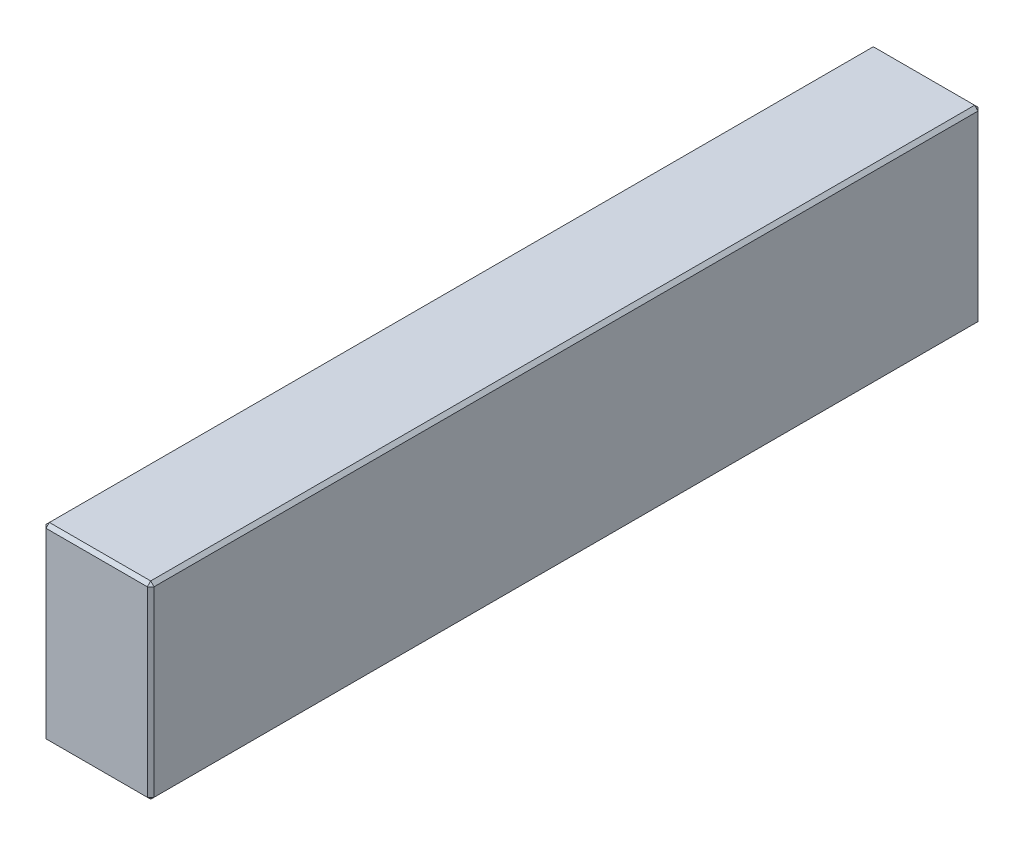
ISO-10303-21;
HEADER;
FILE_DESCRIPTION(('STEP AP214'),'2;1');
FILE_NAME('part.step','',(''),(''),'','','');
FILE_SCHEMA(('AUTOMOTIVE_DESIGN { 1 0 10303 214 1 1 1 1 }'));
ENDSEC;
DATA;
#1=APPLICATION_CONTEXT('core data for automotive mechanical design processes');
#2=APPLICATION_PROTOCOL_DEFINITION('international standard','automotive_design',2000,#1);
#3=PRODUCT_CONTEXT('',#1,'mechanical');
#4=PRODUCT('Part','Part','',(#3));
#5=PRODUCT_RELATED_PRODUCT_CATEGORY('part','',(#4));
#6=PRODUCT_DEFINITION_FORMATION('','',#4);
#7=PRODUCT_DEFINITION_CONTEXT('part definition',#1,'design');
#8=PRODUCT_DEFINITION('design','',#6,#7);
#9=PRODUCT_DEFINITION_SHAPE('','',#8);
#10=(LENGTH_UNIT() NAMED_UNIT(*) SI_UNIT(.MILLI.,.METRE.));
#11=(NAMED_UNIT(*) PLANE_ANGLE_UNIT() SI_UNIT($,.RADIAN.));
#12=(NAMED_UNIT(*) SI_UNIT($,.STERADIAN.) SOLID_ANGLE_UNIT());
#13=UNCERTAINTY_MEASURE_WITH_UNIT(LENGTH_MEASURE(1.E-05),#10,'distance_accuracy_value','');
#14=(GEOMETRIC_REPRESENTATION_CONTEXT(3) GLOBAL_UNCERTAINTY_ASSIGNED_CONTEXT((#13)) GLOBAL_UNIT_ASSIGNED_CONTEXT((#10,
#11,#12)) REPRESENTATION_CONTEXT('',''));
#15=CARTESIAN_POINT('',(0.,0.,0.));
#16=DIRECTION('',(0.,0.,1.));
#17=DIRECTION('',(1.,0.,0.));
#18=AXIS2_PLACEMENT_3D('',#15,#16,#17);
#19=CARTESIAN_POINT('',(-16.,56.,123.));
#20=DIRECTION('',(1.,0.,0.));
#21=DIRECTION('',(0.,0.,-1.));
#22=AXIS2_PLACEMENT_3D('',#19,#20,#21);
#23=PLANE('',#22);
#24=DIRECTION('',(0.,-1.,0.));
#25=VECTOR('',#24,1.);
#26=CARTESIAN_POINT('',(-16.,56.,-122.));
#27=LINE('',#26,#25);
#28=CARTESIAN_POINT('',(-16.,55.,-122.));
#29=VERTEX_POINT('',#28);
#30=CARTESIAN_POINT('',(-16.,1.,-122.));
#31=VERTEX_POINT('',#30);
#32=EDGE_CURVE('E115',#29,#31,#27,.T.);
#33=ORIENTED_EDGE('',*,*,#32,.T.);
#34=DIRECTION('',(0.,0.,1.));
#35=VECTOR('',#34,1.);
#36=CARTESIAN_POINT('',(-16.,1.,123.));
#37=LINE('',#36,#35);
#38=CARTESIAN_POINT('',(-16.,1.,122.));
#39=VERTEX_POINT('',#38);
#40=EDGE_CURVE('E111',#31,#39,#37,.T.);
#41=ORIENTED_EDGE('',*,*,#40,.T.);
#42=DIRECTION('',(0.,1.,0.));
#43=VECTOR('',#42,1.);
#44=CARTESIAN_POINT('',(-16.,56.,122.));
#45=LINE('',#44,#43);
#46=CARTESIAN_POINT('',(-16.,55.,122.));
#47=VERTEX_POINT('',#46);
#48=EDGE_CURVE('E104',#39,#47,#45,.T.);
#49=ORIENTED_EDGE('',*,*,#48,.T.);
#50=DIRECTION('',(0.,0.,-1.));
#51=VECTOR('',#50,1.);
#52=CARTESIAN_POINT('',(-16.,55.,-123.));
#53=LINE('',#52,#51);
#54=EDGE_CURVE('E108',#47,#29,#53,.T.);
#55=ORIENTED_EDGE('',*,*,#54,.T.);
#56=EDGE_LOOP('',(#33,#41,#49,#55));
#57=FACE_BOUND('',#56,.T.);
#58=ADVANCED_FACE('F16',(#57),#23,.F.);
#59=CARTESIAN_POINT('',(16.,56.,123.));
#60=DIRECTION('',(0.,0.,-1.));
#61=DIRECTION('',(-1.,0.,0.));
#62=AXIS2_PLACEMENT_3D('',#59,#60,#61);
#63=PLANE('',#62);
#64=DIRECTION('',(-1.,0.,0.));
#65=VECTOR('',#64,1.);
#66=CARTESIAN_POINT('',(-16.,55.,123.));
#67=LINE('',#66,#65);
#68=CARTESIAN_POINT('',(15.,55.,123.));
#69=VERTEX_POINT('',#68);
#70=CARTESIAN_POINT('',(-15.,55.,123.));
#71=VERTEX_POINT('',#70);
#72=EDGE_CURVE('E165',#69,#71,#67,.T.);
#73=ORIENTED_EDGE('',*,*,#72,.T.);
#74=DIRECTION('',(0.,-1.,0.));
#75=VECTOR('',#74,1.);
#76=CARTESIAN_POINT('',(-15.,56.,123.));
#77=LINE('',#76,#75);
#78=CARTESIAN_POINT('',(-15.,1.,123.));
#79=VERTEX_POINT('',#78);
#80=EDGE_CURVE('E123',#71,#79,#77,.T.);
#81=ORIENTED_EDGE('',*,*,#80,.T.);
#82=DIRECTION('',(1.,0.,0.));
#83=VECTOR('',#82,1.);
#84=CARTESIAN_POINT('',(16.,1.,123.));
#85=LINE('',#84,#83);
#86=CARTESIAN_POINT('',(15.,1.,123.));
#87=VERTEX_POINT('',#86);
#88=EDGE_CURVE('E169',#79,#87,#85,.T.);
#89=ORIENTED_EDGE('',*,*,#88,.T.);
#90=DIRECTION('',(0.,1.,0.));
#91=VECTOR('',#90,1.);
#92=CARTESIAN_POINT('',(15.,56.,123.));
#93=LINE('',#92,#91);
#94=EDGE_CURVE('E167',#87,#69,#93,.T.);
#95=ORIENTED_EDGE('',*,*,#94,.T.);
#96=EDGE_LOOP('',(#73,#81,#89,#95));
#97=FACE_BOUND('',#96,.T.);
#98=ADVANCED_FACE('F276',(#97),#63,.F.);
#99=CARTESIAN_POINT('',(16.,56.,123.));
#100=DIRECTION('',(-1.,0.,0.));
#101=DIRECTION('',(0.,0.,1.));
#102=AXIS2_PLACEMENT_3D('',#99,#100,#101);
#103=PLANE('',#102);
#104=DIRECTION('',(0.,0.,-1.));
#105=VECTOR('',#104,1.);
#106=CARTESIAN_POINT('',(16.,1.,123.));
#107=LINE('',#106,#105);
#108=CARTESIAN_POINT('',(16.,1.,122.));
#109=VERTEX_POINT('',#108);
#110=CARTESIAN_POINT('',(16.,1.,-122.));
#111=VERTEX_POINT('',#110);
#112=EDGE_CURVE('E160',#109,#111,#107,.T.);
#113=ORIENTED_EDGE('',*,*,#112,.T.);
#114=DIRECTION('',(0.,1.,0.));
#115=VECTOR('',#114,1.);
#116=CARTESIAN_POINT('',(16.,56.,-122.));
#117=LINE('',#116,#115);
#118=CARTESIAN_POINT('',(16.,55.,-122.));
#119=VERTEX_POINT('',#118);
#120=EDGE_CURVE('E162',#111,#119,#117,.T.);
#121=ORIENTED_EDGE('',*,*,#120,.T.);
#122=DIRECTION('',(0.,0.,1.));
#123=VECTOR('',#122,1.);
#124=CARTESIAN_POINT('',(16.,55.,123.));
#125=LINE('',#124,#123);
#126=CARTESIAN_POINT('',(16.,55.,122.));
#127=VERTEX_POINT('',#126);
#128=EDGE_CURVE('E156',#119,#127,#125,.T.);
#129=ORIENTED_EDGE('',*,*,#128,.T.);
#130=DIRECTION('',(0.,-1.,0.));
#131=VECTOR('',#130,1.);
#132=CARTESIAN_POINT('',(16.,56.,122.));
#133=LINE('',#132,#131);
#134=EDGE_CURVE('E158',#127,#109,#133,.T.);
#135=ORIENTED_EDGE('',*,*,#134,.T.);
#136=EDGE_LOOP('',(#113,#121,#129,#135));
#137=FACE_BOUND('',#136,.T.);
#138=ADVANCED_FACE('F255',(#137),#103,.F.);
#139=CARTESIAN_POINT('',(16.,56.,-123.));
#140=DIRECTION('',(0.,0.,1.));
#141=DIRECTION('',(1.,0.,0.));
#142=AXIS2_PLACEMENT_3D('',#139,#140,#141);
#143=PLANE('',#142);
#144=DIRECTION('',(0.,-1.,0.));
#145=VECTOR('',#144,1.);
#146=CARTESIAN_POINT('',(15.,56.,-123.));
#147=LINE('',#146,#145);
#148=CARTESIAN_POINT('',(15.,55.,-123.));
#149=VERTEX_POINT('',#148);
#150=CARTESIAN_POINT('',(15.,1.,-123.));
#151=VERTEX_POINT('',#150);
#152=EDGE_CURVE('E149',#149,#151,#147,.T.);
#153=ORIENTED_EDGE('',*,*,#152,.T.);
#154=DIRECTION('',(-1.,0.,0.));
#155=VECTOR('',#154,1.);
#156=CARTESIAN_POINT('',(16.,1.,-123.));
#157=LINE('',#156,#155);
#158=CARTESIAN_POINT('',(-15.,1.,-123.));
#159=VERTEX_POINT('',#158);
#160=EDGE_CURVE('E154',#151,#159,#157,.T.);
#161=ORIENTED_EDGE('',*,*,#160,.T.);
#162=DIRECTION('',(0.,1.,0.));
#163=VECTOR('',#162,1.);
#164=CARTESIAN_POINT('',(-15.,56.,-123.));
#165=LINE('',#164,#163);
#166=CARTESIAN_POINT('',(-15.,55.,-123.));
#167=VERTEX_POINT('',#166);
#168=EDGE_CURVE('E151',#159,#167,#165,.T.);
#169=ORIENTED_EDGE('',*,*,#168,.T.);
#170=DIRECTION('',(1.,0.,0.));
#171=VECTOR('',#170,1.);
#172=CARTESIAN_POINT('',(16.,55.,-123.));
#173=LINE('',#172,#171);
#174=EDGE_CURVE('E147',#167,#149,#173,.T.);
#175=ORIENTED_EDGE('',*,*,#174,.T.);
#176=EDGE_LOOP('',(#153,#161,#169,#175));
#177=FACE_BOUND('',#176,.T.);
#178=ADVANCED_FACE('F285',(#177),#143,.F.);
#179=CARTESIAN_POINT('',(0.,56.,0.));
#180=DIRECTION('',(0.,1.,0.));
#181=DIRECTION('',(0.,0.,1.));
#182=AXIS2_PLACEMENT_3D('',#179,#180,#181);
#183=PLANE('',#182);
#184=DIRECTION('',(0.,0.,-1.));
#185=VECTOR('',#184,1.);
#186=CARTESIAN_POINT('',(15.,56.,-123.));
#187=LINE('',#186,#185);
#188=CARTESIAN_POINT('',(15.,56.,122.));
#189=VERTEX_POINT('',#188);
#190=CARTESIAN_POINT('',(15.,56.,-122.));
#191=VERTEX_POINT('',#190);
#192=EDGE_CURVE('E25',#189,#191,#187,.T.);
#193=ORIENTED_EDGE('',*,*,#192,.T.);
#194=DIRECTION('',(-1.,0.,0.));
#195=VECTOR('',#194,1.);
#196=CARTESIAN_POINT('',(-16.,56.,-122.));
#197=LINE('',#196,#195);
#198=CARTESIAN_POINT('',(-15.,56.,-122.));
#199=VERTEX_POINT('',#198);
#200=EDGE_CURVE('E10',#191,#199,#197,.T.);
#201=ORIENTED_EDGE('',*,*,#200,.T.);
#202=DIRECTION('',(0.,0.,1.));
#203=VECTOR('',#202,1.);
#204=CARTESIAN_POINT('',(-15.,56.,123.));
#205=LINE('',#204,#203);
#206=CARTESIAN_POINT('',(-15.,56.,122.));
#207=VERTEX_POINT('',#206);
#208=EDGE_CURVE('E181',#199,#207,#205,.T.);
#209=ORIENTED_EDGE('',*,*,#208,.T.);
#210=DIRECTION('',(1.,0.,0.));
#211=VECTOR('',#210,1.);
#212=CARTESIAN_POINT('',(16.,56.,122.));
#213=LINE('',#212,#211);
#214=EDGE_CURVE('E36',#207,#189,#213,.T.);
#215=ORIENTED_EDGE('',*,*,#214,.T.);
#216=EDGE_LOOP('',(#193,#201,#209,#215));
#217=FACE_BOUND('',#216,.T.);
#218=ADVANCED_FACE('F351',(#217),#183,.T.);
#219=CARTESIAN_POINT('',(0.,0.,0.));
#220=DIRECTION('',(0.,1.,0.));
#221=DIRECTION('',(0.,0.,1.));
#222=AXIS2_PLACEMENT_3D('',#219,#220,#221);
#223=PLANE('',#222);
#224=DIRECTION('',(0.,0.,1.));
#225=VECTOR('',#224,1.);
#226=CARTESIAN_POINT('',(15.,0.,0.));
#227=LINE('',#226,#225);
#228=CARTESIAN_POINT('',(15.,0.,-122.));
#229=VERTEX_POINT('',#228);
#230=CARTESIAN_POINT('',(15.,0.,122.));
#231=VERTEX_POINT('',#230);
#232=EDGE_CURVE('E172',#229,#231,#227,.T.);
#233=ORIENTED_EDGE('',*,*,#232,.T.);
#234=DIRECTION('',(-1.,0.,0.));
#235=VECTOR('',#234,1.);
#236=CARTESIAN_POINT('',(0.,0.,122.));
#237=LINE('',#236,#235);
#238=CARTESIAN_POINT('',(-15.,0.,122.));
#239=VERTEX_POINT('',#238);
#240=EDGE_CURVE('E178',#231,#239,#237,.T.);
#241=ORIENTED_EDGE('',*,*,#240,.T.);
#242=DIRECTION('',(0.,0.,-1.));
#243=VECTOR('',#242,1.);
#244=CARTESIAN_POINT('',(-15.,0.,0.));
#245=LINE('',#244,#243);
#246=CARTESIAN_POINT('',(-15.,0.,-122.));
#247=VERTEX_POINT('',#246);
#248=EDGE_CURVE('E176',#239,#247,#245,.T.);
#249=ORIENTED_EDGE('',*,*,#248,.T.);
#250=DIRECTION('',(1.,0.,0.));
#251=VECTOR('',#250,1.);
#252=CARTESIAN_POINT('',(0.,0.,-122.));
#253=LINE('',#252,#251);
#254=EDGE_CURVE('E174',#247,#229,#253,.T.);
#255=ORIENTED_EDGE('',*,*,#254,.T.);
#256=EDGE_LOOP('',(#233,#241,#249,#255));
#257=FACE_BOUND('',#256,.T.);
#258=ADVANCED_FACE('F247',(#257),#223,.F.);
#259=CARTESIAN_POINT('',(16.,56.,122.));
#260=DIRECTION('',(-0.707106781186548,0.,-0.707106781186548));
#261=DIRECTION('',(0.,-1.,0.));
#262=AXIS2_PLACEMENT_3D('',#259,#260,#261);
#263=PLANE('',#262);
#264=DIRECTION('',(-0.707106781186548,0.,0.707106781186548));
#265=VECTOR('',#264,1.);
#266=CARTESIAN_POINT('',(15.,55.,123.));
#267=LINE('',#266,#265);
#268=EDGE_CURVE('E20',#69,#127,#267,.F.);
#269=ORIENTED_EDGE('',*,*,#268,.F.);
#270=ORIENTED_EDGE('',*,*,#94,.F.);
#271=DIRECTION('',(0.707106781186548,0.,-0.707106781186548));
#272=VECTOR('',#271,1.);
#273=CARTESIAN_POINT('',(15.,1.,123.));
#274=LINE('',#273,#272);
#275=EDGE_CURVE('E143',#109,#87,#274,.F.);
#276=ORIENTED_EDGE('',*,*,#275,.F.);
#277=ORIENTED_EDGE('',*,*,#134,.F.);
#278=EDGE_LOOP('',(#269,#270,#276,#277));
#279=FACE_BOUND('',#278,.T.);
#280=ADVANCED_FACE('F18',(#279),#263,.F.);
#281=CARTESIAN_POINT('',(15.,55.,123.));
#282=DIRECTION('',(0.577350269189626,0.577350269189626,0.577350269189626));
#283=DIRECTION('',(0.707106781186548,0.,-0.707106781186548));
#284=AXIS2_PLACEMENT_3D('',#281,#282,#283);
#285=PLANE('',#284);
#286=DIRECTION('',(0.,-0.707106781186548,0.707106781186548));
#287=VECTOR('',#286,1.);
#288=CARTESIAN_POINT('',(15.,55.,123.));
#289=LINE('',#288,#287);
#290=EDGE_CURVE('E227',#69,#189,#289,.F.);
#291=ORIENTED_EDGE('',*,*,#290,.F.);
#292=ORIENTED_EDGE('',*,*,#268,.T.);
#293=DIRECTION('',(-0.707106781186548,0.707106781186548,0.));
#294=VECTOR('',#293,1.);
#295=CARTESIAN_POINT('',(15.5,55.5,122.));
#296=LINE('',#295,#294);
#297=EDGE_CURVE('E229',#189,#127,#296,.F.);
#298=ORIENTED_EDGE('',*,*,#297,.F.);
#299=EDGE_LOOP('',(#291,#292,#298));
#300=FACE_BOUND('',#299,.T.);
#301=ADVANCED_FACE('F271',(#300),#285,.T.);
#302=CARTESIAN_POINT('',(15.,1.,123.));
#303=DIRECTION('',(0.577350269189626,-0.577350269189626,0.577350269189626));
#304=DIRECTION('',(0.707106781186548,0.,-0.707106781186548));
#305=AXIS2_PLACEMENT_3D('',#302,#303,#304);
#306=PLANE('',#305);
#307=DIRECTION('',(-0.707106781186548,-0.707106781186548,0.));
#308=VECTOR('',#307,1.);
#309=CARTESIAN_POINT('',(15.5,0.5,122.));
#310=LINE('',#309,#308);
#311=EDGE_CURVE('E221',#109,#231,#310,.T.);
#312=ORIENTED_EDGE('',*,*,#311,.F.);
#313=ORIENTED_EDGE('',*,*,#275,.T.);
#314=DIRECTION('',(0.,0.707106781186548,0.707106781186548));
#315=VECTOR('',#314,1.);
#316=CARTESIAN_POINT('',(15.,1.,123.));
#317=LINE('',#316,#315);
#318=EDGE_CURVE('E224',#231,#87,#317,.T.);
#319=ORIENTED_EDGE('',*,*,#318,.F.);
#320=EDGE_LOOP('',(#312,#313,#319));
#321=FACE_BOUND('',#320,.T.);
#322=ADVANCED_FACE('F236',(#321),#306,.T.);
#323=CARTESIAN_POINT('',(15.,56.,0.));
#324=DIRECTION('',(0.707106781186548,0.707106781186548,0.));
#325=DIRECTION('',(0.,0.,1.));
#326=AXIS2_PLACEMENT_3D('',#323,#324,#325);
#327=PLANE('',#326);
#328=ORIENTED_EDGE('',*,*,#297,.T.);
#329=ORIENTED_EDGE('',*,*,#128,.F.);
#330=DIRECTION('',(0.707106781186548,-0.707106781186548,0.));
#331=VECTOR('',#330,1.);
#332=CARTESIAN_POINT('',(16.,55.,-122.));
#333=LINE('',#332,#331);
#334=EDGE_CURVE('E216',#191,#119,#333,.T.);
#335=ORIENTED_EDGE('',*,*,#334,.F.);
#336=ORIENTED_EDGE('',*,*,#192,.F.);
#337=EDGE_LOOP('',(#328,#329,#335,#336));
#338=FACE_BOUND('',#337,.T.);
#339=ADVANCED_FACE('F266',(#338),#327,.T.);
#340=CARTESIAN_POINT('',(0.,56.,122.));
#341=DIRECTION('',(0.,0.707106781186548,0.707106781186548));
#342=DIRECTION('',(-1.,0.,0.));
#343=AXIS2_PLACEMENT_3D('',#340,#341,#342);
#344=PLANE('',#343);
#345=ORIENTED_EDGE('',*,*,#290,.T.);
#346=ORIENTED_EDGE('',*,*,#214,.F.);
#347=DIRECTION('',(0.,0.707106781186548,-0.707106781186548));
#348=VECTOR('',#347,1.);
#349=CARTESIAN_POINT('',(-15.,55.5,122.5));
#350=LINE('',#349,#348);
#351=EDGE_CURVE('E127',#71,#207,#350,.T.);
#352=ORIENTED_EDGE('',*,*,#351,.F.);
#353=ORIENTED_EDGE('',*,*,#72,.F.);
#354=EDGE_LOOP('',(#345,#346,#352,#353));
#355=FACE_BOUND('',#354,.T.);
#356=ADVANCED_FACE('F274',(#355),#344,.T.);
#357=CARTESIAN_POINT('',(-15.,56.,123.));
#358=DIRECTION('',(0.707106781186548,0.,-0.707106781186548));
#359=DIRECTION('',(0.,-1.,0.));
#360=AXIS2_PLACEMENT_3D('',#357,#358,#359);
#361=PLANE('',#360);
#362=DIRECTION('',(0.707106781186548,0.,0.707106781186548));
#363=VECTOR('',#362,1.);
#364=CARTESIAN_POINT('',(-15.,1.,123.));
#365=LINE('',#364,#363);
#366=EDGE_CURVE('E128',#79,#39,#365,.F.);
#367=ORIENTED_EDGE('',*,*,#366,.F.);
#368=ORIENTED_EDGE('',*,*,#80,.F.);
#369=DIRECTION('',(-0.707106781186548,0.,-0.707106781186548));
#370=VECTOR('',#369,1.);
#371=CARTESIAN_POINT('',(-16.,55.,122.));
#372=LINE('',#371,#370);
#373=EDGE_CURVE('E119',#47,#71,#372,.F.);
#374=ORIENTED_EDGE('',*,*,#373,.F.);
#375=ORIENTED_EDGE('',*,*,#48,.F.);
#376=EDGE_LOOP('',(#367,#368,#374,#375));
#377=FACE_BOUND('',#376,.T.);
#378=ADVANCED_FACE('F121',(#377),#361,.F.);
#379=CARTESIAN_POINT('',(16.,1.,123.));
#380=DIRECTION('',(0.,0.707106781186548,-0.707106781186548));
#381=DIRECTION('',(1.,0.,0.));
#382=AXIS2_PLACEMENT_3D('',#379,#380,#381);
#383=PLANE('',#382);
#384=ORIENTED_EDGE('',*,*,#318,.T.);
#385=ORIENTED_EDGE('',*,*,#88,.F.);
#386=DIRECTION('',(0.,-0.707106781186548,-0.707106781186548));
#387=VECTOR('',#386,1.);
#388=CARTESIAN_POINT('',(-15.,1.,123.));
#389=LINE('',#388,#387);
#390=EDGE_CURVE('E212',#239,#79,#389,.F.);
#391=ORIENTED_EDGE('',*,*,#390,.F.);
#392=ORIENTED_EDGE('',*,*,#240,.F.);
#393=EDGE_LOOP('',(#384,#385,#391,#392));
#394=FACE_BOUND('',#393,.T.);
#395=ADVANCED_FACE('F244',(#394),#383,.F.);
#396=CARTESIAN_POINT('',(16.,1.,123.));
#397=DIRECTION('',(-0.707106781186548,0.707106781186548,0.));
#398=DIRECTION('',(0.,0.,-1.));
#399=AXIS2_PLACEMENT_3D('',#396,#397,#398);
#400=PLANE('',#399);
#401=ORIENTED_EDGE('',*,*,#311,.T.);
#402=ORIENTED_EDGE('',*,*,#232,.F.);
#403=DIRECTION('',(0.707106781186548,0.707106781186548,0.));
#404=VECTOR('',#403,1.);
#405=CARTESIAN_POINT('',(15.5,0.500000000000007,-122.));
#406=LINE('',#405,#404);
#407=EDGE_CURVE('E209',#111,#229,#406,.F.);
#408=ORIENTED_EDGE('',*,*,#407,.F.);
#409=ORIENTED_EDGE('',*,*,#112,.F.);
#410=EDGE_LOOP('',(#401,#402,#408,#409));
#411=FACE_BOUND('',#410,.T.);
#412=ADVANCED_FACE('F252',(#411),#400,.F.);
#413=CARTESIAN_POINT('',(15.,56.,-123.));
#414=DIRECTION('',(-0.707106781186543,0.,0.707106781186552));
#415=DIRECTION('',(0.,-1.,0.));
#416=AXIS2_PLACEMENT_3D('',#413,#414,#415);
#417=PLANE('',#416);
#418=DIRECTION('',(0.707106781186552,0.,0.707106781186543));
#419=VECTOR('',#418,1.);
#420=CARTESIAN_POINT('',(16.,55.,-122.));
#421=LINE('',#420,#419);
#422=EDGE_CURVE('E218',#119,#149,#421,.F.);
#423=ORIENTED_EDGE('',*,*,#422,.F.);
#424=ORIENTED_EDGE('',*,*,#120,.F.);
#425=DIRECTION('',(-0.707106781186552,0.,-0.707106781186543));
#426=VECTOR('',#425,1.);
#427=CARTESIAN_POINT('',(15.,1.,-123.));
#428=LINE('',#427,#426);
#429=EDGE_CURVE('E206',#151,#111,#428,.F.);
#430=ORIENTED_EDGE('',*,*,#429,.F.);
#431=ORIENTED_EDGE('',*,*,#152,.F.);
#432=EDGE_LOOP('',(#423,#424,#430,#431));
#433=FACE_BOUND('',#432,.T.);
#434=ADVANCED_FACE('F259',(#433),#417,.F.);
#435=CARTESIAN_POINT('',(16.,55.,-122.));
#436=DIRECTION('',(0.57735026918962,0.577350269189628,-0.577350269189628));
#437=DIRECTION('',(0.,0.707106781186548,0.707106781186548));
#438=AXIS2_PLACEMENT_3D('',#435,#436,#437);
#439=PLANE('',#438);
#440=ORIENTED_EDGE('',*,*,#334,.T.);
#441=ORIENTED_EDGE('',*,*,#422,.T.);
#442=DIRECTION('',(0.,0.707106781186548,0.707106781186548));
#443=VECTOR('',#442,1.);
#444=CARTESIAN_POINT('',(15.,55.5,-122.5));
#445=LINE('',#444,#443);
#446=EDGE_CURVE('E135',#191,#149,#445,.F.);
#447=ORIENTED_EDGE('',*,*,#446,.F.);
#448=EDGE_LOOP('',(#440,#441,#447));
#449=FACE_BOUND('',#448,.T.);
#450=ADVANCED_FACE('F326',(#449),#439,.T.);
#451=CARTESIAN_POINT('',(-16.,55.,122.));
#452=DIRECTION('',(-0.577350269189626,0.577350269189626,0.577350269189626));
#453=DIRECTION('',(0.707106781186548,0.,0.707106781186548));
#454=AXIS2_PLACEMENT_3D('',#451,#452,#453);
#455=PLANE('',#454);
#456=ORIENTED_EDGE('',*,*,#373,.T.);
#457=ORIENTED_EDGE('',*,*,#351,.T.);
#458=DIRECTION('',(-0.707106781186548,-0.707106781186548,0.));
#459=VECTOR('',#458,1.);
#460=CARTESIAN_POINT('',(-16.,55.,122.));
#461=LINE('',#460,#459);
#462=EDGE_CURVE('E131',#47,#207,#461,.F.);
#463=ORIENTED_EDGE('',*,*,#462,.F.);
#464=EDGE_LOOP('',(#456,#457,#463));
#465=FACE_BOUND('',#464,.T.);
#466=ADVANCED_FACE('F132',(#465),#455,.T.);
#467=CARTESIAN_POINT('',(-15.,1.,123.));
#468=DIRECTION('',(-0.577350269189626,-0.577350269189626,0.577350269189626));
#469=DIRECTION('',(0.707106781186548,0.,0.707106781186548));
#470=AXIS2_PLACEMENT_3D('',#467,#468,#469);
#471=PLANE('',#470);
#472=ORIENTED_EDGE('',*,*,#390,.T.);
#473=ORIENTED_EDGE('',*,*,#366,.T.);
#474=DIRECTION('',(-0.707106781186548,0.707106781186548,0.));
#475=VECTOR('',#474,1.);
#476=CARTESIAN_POINT('',(-15.5,0.5,122.));
#477=LINE('',#476,#475);
#478=EDGE_CURVE('E136',#239,#39,#477,.T.);
#479=ORIENTED_EDGE('',*,*,#478,.F.);
#480=EDGE_LOOP('',(#472,#473,#479));
#481=FACE_BOUND('',#480,.T.);
#482=ADVANCED_FACE('F319',(#481),#471,.T.);
#483=CARTESIAN_POINT('',(15.,1.,-123.));
#484=DIRECTION('',(0.57735026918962,-0.577350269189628,-0.577350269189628));
#485=DIRECTION('',(0.,0.707106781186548,-0.707106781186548));
#486=AXIS2_PLACEMENT_3D('',#483,#484,#485);
#487=PLANE('',#486);
#488=ORIENTED_EDGE('',*,*,#429,.T.);
#489=ORIENTED_EDGE('',*,*,#407,.T.);
#490=DIRECTION('',(0.,-0.707106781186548,0.707106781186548));
#491=VECTOR('',#490,1.);
#492=CARTESIAN_POINT('',(15.,1.,-123.));
#493=LINE('',#492,#491);
#494=EDGE_CURVE('E199',#151,#229,#493,.T.);
#495=ORIENTED_EDGE('',*,*,#494,.F.);
#496=EDGE_LOOP('',(#488,#489,#495));
#497=FACE_BOUND('',#496,.T.);
#498=ADVANCED_FACE('F315',(#497),#487,.T.);
#499=CARTESIAN_POINT('',(0.,56.,-122.));
#500=DIRECTION('',(0.,0.707106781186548,-0.707106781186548));
#501=DIRECTION('',(1.,0.,0.));
#502=AXIS2_PLACEMENT_3D('',#499,#500,#501);
#503=PLANE('',#502);
#504=ORIENTED_EDGE('',*,*,#446,.T.);
#505=ORIENTED_EDGE('',*,*,#174,.F.);
#506=DIRECTION('',(0.,-0.707106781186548,-0.707106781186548));
#507=VECTOR('',#506,1.);
#508=CARTESIAN_POINT('',(-15.,55.,-123.));
#509=LINE('',#508,#507);
#510=EDGE_CURVE('E196',#199,#167,#509,.T.);
#511=ORIENTED_EDGE('',*,*,#510,.F.);
#512=ORIENTED_EDGE('',*,*,#200,.F.);
#513=EDGE_LOOP('',(#504,#505,#511,#512));
#514=FACE_BOUND('',#513,.T.);
#515=ADVANCED_FACE('F312',(#514),#503,.T.);
#516=CARTESIAN_POINT('',(-15.,56.,0.));
#517=DIRECTION('',(-0.707106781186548,0.707106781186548,0.));
#518=DIRECTION('',(0.,0.,-1.));
#519=AXIS2_PLACEMENT_3D('',#516,#517,#518);
#520=PLANE('',#519);
#521=ORIENTED_EDGE('',*,*,#462,.T.);
#522=ORIENTED_EDGE('',*,*,#208,.F.);
#523=DIRECTION('',(0.707106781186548,0.707106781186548,0.));
#524=VECTOR('',#523,1.);
#525=CARTESIAN_POINT('',(-15.5,55.5,-122.));
#526=LINE('',#525,#524);
#527=EDGE_CURVE('E139',#29,#199,#526,.T.);
#528=ORIENTED_EDGE('',*,*,#527,.F.);
#529=ORIENTED_EDGE('',*,*,#54,.F.);
#530=EDGE_LOOP('',(#521,#522,#528,#529));
#531=FACE_BOUND('',#530,.T.);
#532=ADVANCED_FACE('F138',(#531),#520,.T.);
#533=CARTESIAN_POINT('',(-16.,1.,123.));
#534=DIRECTION('',(0.707106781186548,0.707106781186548,0.));
#535=DIRECTION('',(0.,0.,1.));
#536=AXIS2_PLACEMENT_3D('',#533,#534,#535);
#537=PLANE('',#536);
#538=ORIENTED_EDGE('',*,*,#478,.T.);
#539=ORIENTED_EDGE('',*,*,#40,.F.);
#540=DIRECTION('',(0.707106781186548,-0.707106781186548,0.));
#541=VECTOR('',#540,1.);
#542=CARTESIAN_POINT('',(-16.,1.,-122.));
#543=LINE('',#542,#541);
#544=EDGE_CURVE('E192',#247,#31,#543,.F.);
#545=ORIENTED_EDGE('',*,*,#544,.F.);
#546=ORIENTED_EDGE('',*,*,#248,.F.);
#547=EDGE_LOOP('',(#538,#539,#545,#546));
#548=FACE_BOUND('',#547,.T.);
#549=ADVANCED_FACE('F305',(#548),#537,.F.);
#550=CARTESIAN_POINT('',(16.,1.,-123.));
#551=DIRECTION('',(0.,0.707106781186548,0.707106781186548));
#552=DIRECTION('',(-1.,0.,0.));
#553=AXIS2_PLACEMENT_3D('',#550,#551,#552);
#554=PLANE('',#553);
#555=ORIENTED_EDGE('',*,*,#494,.T.);
#556=ORIENTED_EDGE('',*,*,#254,.F.);
#557=DIRECTION('',(0.,0.707106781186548,-0.707106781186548));
#558=VECTOR('',#557,1.);
#559=CARTESIAN_POINT('',(-15.,0.500000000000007,-122.5));
#560=LINE('',#559,#558);
#561=EDGE_CURVE('E189',#159,#247,#560,.F.);
#562=ORIENTED_EDGE('',*,*,#561,.F.);
#563=ORIENTED_EDGE('',*,*,#160,.F.);
#564=EDGE_LOOP('',(#555,#556,#562,#563));
#565=FACE_BOUND('',#564,.T.);
#566=ADVANCED_FACE('F301',(#565),#554,.F.);
#567=CARTESIAN_POINT('',(-15.,55.,-123.));
#568=DIRECTION('',(-0.57735026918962,0.577350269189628,-0.577350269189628));
#569=DIRECTION('',(0.,0.707106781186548,0.707106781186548));
#570=AXIS2_PLACEMENT_3D('',#567,#568,#569);
#571=PLANE('',#570);
#572=ORIENTED_EDGE('',*,*,#527,.T.);
#573=ORIENTED_EDGE('',*,*,#510,.T.);
#574=DIRECTION('',(0.707106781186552,0.,-0.707106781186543));
#575=VECTOR('',#574,1.);
#576=CARTESIAN_POINT('',(-15.,55.,-123.));
#577=LINE('',#576,#575);
#578=EDGE_CURVE('E187',#29,#167,#577,.T.);
#579=ORIENTED_EDGE('',*,*,#578,.F.);
#580=EDGE_LOOP('',(#572,#573,#579));
#581=FACE_BOUND('',#580,.T.);
#582=ADVANCED_FACE('F297',(#581),#571,.T.);
#583=CARTESIAN_POINT('',(-16.,1.,-122.));
#584=DIRECTION('',(-0.57735026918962,-0.577350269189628,-0.577350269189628));
#585=DIRECTION('',(0.,0.707106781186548,-0.707106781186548));
#586=AXIS2_PLACEMENT_3D('',#583,#584,#585);
#587=PLANE('',#586);
#588=ORIENTED_EDGE('',*,*,#561,.T.);
#589=ORIENTED_EDGE('',*,*,#544,.T.);
#590=DIRECTION('',(-0.707106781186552,0.,0.707106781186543));
#591=VECTOR('',#590,1.);
#592=CARTESIAN_POINT('',(-16.,1.,-122.));
#593=LINE('',#592,#591);
#594=EDGE_CURVE('E185',#159,#31,#593,.T.);
#595=ORIENTED_EDGE('',*,*,#594,.F.);
#596=EDGE_LOOP('',(#588,#589,#595));
#597=FACE_BOUND('',#596,.T.);
#598=ADVANCED_FACE('F293',(#597),#587,.T.);
#599=CARTESIAN_POINT('',(-16.,56.,-122.));
#600=DIRECTION('',(0.707106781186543,0.,0.707106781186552));
#601=DIRECTION('',(0.,-1.,0.));
#602=AXIS2_PLACEMENT_3D('',#599,#600,#601);
#603=PLANE('',#602);
#604=ORIENTED_EDGE('',*,*,#578,.T.);
#605=ORIENTED_EDGE('',*,*,#168,.F.);
#606=ORIENTED_EDGE('',*,*,#594,.T.);
#607=ORIENTED_EDGE('',*,*,#32,.F.);
#608=EDGE_LOOP('',(#604,#605,#606,#607));
#609=FACE_BOUND('',#608,.T.);
#610=ADVANCED_FACE('F290',(#609),#603,.F.);
#611=CLOSED_SHELL('',(#58,#98,#138,#178,#218,#258,#280,#301,#322,#339,#356,#378,#395,#412,#434,
#450,#466,#482,#498,#515,#532,#549,#566,#582,#598,#610));
#612=MANIFOLD_SOLID_BREP('B1',#611);
#613=ADVANCED_BREP_SHAPE_REPRESENTATION('',(#18,#612),#14);
#614=SHAPE_DEFINITION_REPRESENTATION(#9,#613);
ENDSEC;
END-ISO-10303-21;
